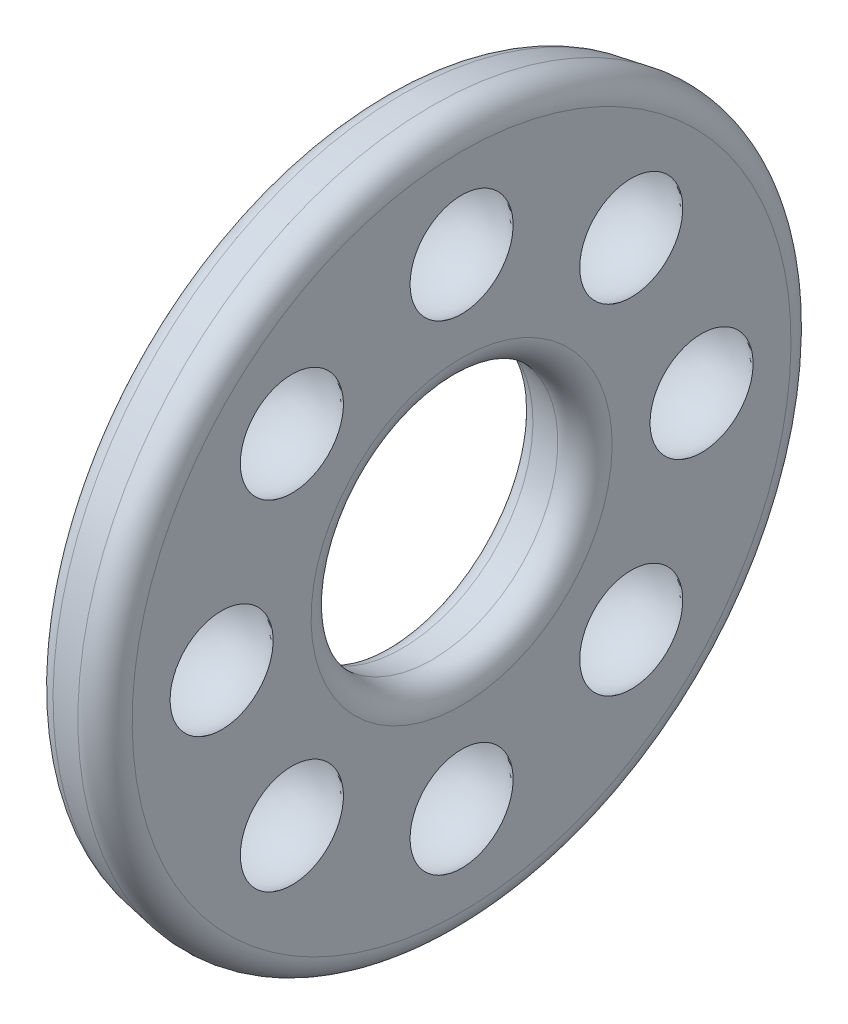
ISO-10303-21;
HEADER;
FILE_DESCRIPTION(('STEP AP214'),'2;1');
FILE_NAME('part.step','',(''),(''),'','','');
FILE_SCHEMA(('AUTOMOTIVE_DESIGN { 1 0 10303 214 1 1 1 1 }'));
ENDSEC;
DATA;
#1=APPLICATION_CONTEXT('core data for automotive mechanical design processes');
#2=APPLICATION_PROTOCOL_DEFINITION('international standard','automotive_design',2000,#1);
#3=PRODUCT_CONTEXT('',#1,'mechanical');
#4=PRODUCT('Part','Part','',(#3));
#5=PRODUCT_RELATED_PRODUCT_CATEGORY('part','',(#4));
#6=PRODUCT_DEFINITION_FORMATION('','',#4);
#7=PRODUCT_DEFINITION_CONTEXT('part definition',#1,'design');
#8=PRODUCT_DEFINITION('design','',#6,#7);
#9=PRODUCT_DEFINITION_SHAPE('','',#8);
#10=(LENGTH_UNIT() NAMED_UNIT(*) SI_UNIT(.MILLI.,.METRE.));
#11=(NAMED_UNIT(*) PLANE_ANGLE_UNIT() SI_UNIT($,.RADIAN.));
#12=(NAMED_UNIT(*) SI_UNIT($,.STERADIAN.) SOLID_ANGLE_UNIT());
#13=UNCERTAINTY_MEASURE_WITH_UNIT(LENGTH_MEASURE(1.E-05),#10,'distance_accuracy_value','');
#14=(GEOMETRIC_REPRESENTATION_CONTEXT(3) GLOBAL_UNCERTAINTY_ASSIGNED_CONTEXT((#13)) GLOBAL_UNIT_ASSIGNED_CONTEXT((#10,
#11,#12)) REPRESENTATION_CONTEXT('',''));
#15=CARTESIAN_POINT('',(0.,0.,0.));
#16=DIRECTION('',(0.,0.,1.));
#17=DIRECTION('',(1.,0.,0.));
#18=AXIS2_PLACEMENT_3D('',#15,#16,#17);
#19=CARTESIAN_POINT('',(13.64,10.5,0.));
#20=DIRECTION('',(-1.,0.,0.));
#21=DIRECTION('',(0.,0.,1.));
#22=AXIS2_PLACEMENT_3D('',#19,#20,#21);
#23=PLANE('',#22);
#24=CARTESIAN_POINT('',(13.64,0.,0.));
#25=DIRECTION('',(-1.,0.,0.));
#26=DIRECTION('',(0.,1.,0.));
#27=AXIS2_PLACEMENT_3D('',#24,#25,#26);
#28=CIRCLE('',#27,6.8186805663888);
#29=CARTESIAN_POINT('',(13.64,6.8186805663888,0.));
#30=VERTEX_POINT('',#29);
#31=EDGE_CURVE('E88',#30,#30,#28,.T.);
#32=ORIENTED_EDGE('',*,*,#31,.F.);
#33=EDGE_LOOP('',(#32));
#34=FACE_BOUND('',#33,.T.);
#35=CARTESIAN_POINT('',(13.64,10.5,0.));
#36=DIRECTION('',(1.,0.,0.));
#37=DIRECTION('',(0.,0.,-1.));
#38=AXIS2_PLACEMENT_3D('',#35,#36,#37);
#39=CIRCLE('',#38,2.25432916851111);
#40=CARTESIAN_POINT('',(13.64,10.5,-2.25432916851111));
#41=VERTEX_POINT('',#40);
#42=EDGE_CURVE('E11',#41,#41,#39,.T.);
#43=ORIENTED_EDGE('',*,*,#42,.T.);
#44=EDGE_LOOP('',(#43));
#45=FACE_BOUND('',#44,.T.);
#46=CARTESIAN_POINT('',(13.64,7.42462120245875,-7.42462120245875));
#47=DIRECTION('',(1.,0.,0.));
#48=DIRECTION('',(0.,0.,-1.));
#49=AXIS2_PLACEMENT_3D('',#46,#47,#48);
#50=CIRCLE('',#49,2.25432916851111);
#51=CARTESIAN_POINT('',(13.64,7.42462120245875,-9.67895037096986));
#52=VERTEX_POINT('',#51);
#53=EDGE_CURVE('E26',#52,#52,#50,.T.);
#54=ORIENTED_EDGE('',*,*,#53,.T.);
#55=EDGE_LOOP('',(#54));
#56=FACE_BOUND('',#55,.T.);
#57=CARTESIAN_POINT('',(13.64,0.,-10.5));
#58=DIRECTION('',(1.,0.,0.));
#59=DIRECTION('',(0.,0.,-1.));
#60=AXIS2_PLACEMENT_3D('',#57,#58,#59);
#61=CIRCLE('',#60,2.25432916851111);
#62=CARTESIAN_POINT('',(13.64,0.,-12.7543291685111));
#63=VERTEX_POINT('',#62);
#64=EDGE_CURVE('E136',#63,#63,#61,.T.);
#65=ORIENTED_EDGE('',*,*,#64,.T.);
#66=EDGE_LOOP('',(#65));
#67=FACE_BOUND('',#66,.T.);
#68=CARTESIAN_POINT('',(13.64,-7.42462120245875,-7.42462120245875));
#69=DIRECTION('',(1.,0.,0.));
#70=DIRECTION('',(0.,0.,-1.));
#71=AXIS2_PLACEMENT_3D('',#68,#69,#70);
#72=CIRCLE('',#71,2.25432916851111);
#73=CARTESIAN_POINT('',(13.64,-7.42462120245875,-9.67895037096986));
#74=VERTEX_POINT('',#73);
#75=EDGE_CURVE('E130',#74,#74,#72,.T.);
#76=ORIENTED_EDGE('',*,*,#75,.T.);
#77=EDGE_LOOP('',(#76));
#78=FACE_BOUND('',#77,.T.);
#79=CARTESIAN_POINT('',(13.64,-10.5,0.));
#80=DIRECTION('',(1.,0.,0.));
#81=DIRECTION('',(0.,0.,-1.));
#82=AXIS2_PLACEMENT_3D('',#79,#80,#81);
#83=CIRCLE('',#82,2.25432916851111);
#84=CARTESIAN_POINT('',(13.64,-10.5,-2.25432916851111));
#85=VERTEX_POINT('',#84);
#86=EDGE_CURVE('E127',#85,#85,#83,.T.);
#87=ORIENTED_EDGE('',*,*,#86,.T.);
#88=EDGE_LOOP('',(#87));
#89=FACE_BOUND('',#88,.T.);
#90=CARTESIAN_POINT('',(13.64,-7.42462120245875,7.42462120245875));
#91=DIRECTION('',(1.,0.,0.));
#92=DIRECTION('',(0.,0.,-1.));
#93=AXIS2_PLACEMENT_3D('',#90,#91,#92);
#94=CIRCLE('',#93,2.25432916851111);
#95=CARTESIAN_POINT('',(13.64,-7.42462120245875,5.17029203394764));
#96=VERTEX_POINT('',#95);
#97=EDGE_CURVE('E131',#96,#96,#94,.T.);
#98=ORIENTED_EDGE('',*,*,#97,.T.);
#99=EDGE_LOOP('',(#98));
#100=FACE_BOUND('',#99,.T.);
#101=CARTESIAN_POINT('',(13.64,0.,10.5));
#102=DIRECTION('',(1.,0.,0.));
#103=DIRECTION('',(0.,0.,-1.));
#104=AXIS2_PLACEMENT_3D('',#101,#102,#103);
#105=CIRCLE('',#104,2.25432916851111);
#106=CARTESIAN_POINT('',(13.64,0.,8.24567083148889));
#107=VERTEX_POINT('',#106);
#108=EDGE_CURVE('E145',#107,#107,#105,.T.);
#109=ORIENTED_EDGE('',*,*,#108,.T.);
#110=EDGE_LOOP('',(#109));
#111=FACE_BOUND('',#110,.T.);
#112=CARTESIAN_POINT('',(13.64,7.42462120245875,7.42462120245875));
#113=DIRECTION('',(1.,0.,0.));
#114=DIRECTION('',(0.,0.,-1.));
#115=AXIS2_PLACEMENT_3D('',#112,#113,#114);
#116=CIRCLE('',#115,2.25432916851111);
#117=CARTESIAN_POINT('',(13.64,7.42462120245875,5.17029203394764));
#118=VERTEX_POINT('',#117);
#119=EDGE_CURVE('E142',#118,#118,#116,.T.);
#120=ORIENTED_EDGE('',*,*,#119,.T.);
#121=EDGE_LOOP('',(#120));
#122=FACE_BOUND('',#121,.T.);
#123=CARTESIAN_POINT('',(13.64,0.,0.));
#124=DIRECTION('',(-1.,0.,0.));
#125=DIRECTION('',(0.,1.,0.));
#126=AXIS2_PLACEMENT_3D('',#123,#124,#125);
#127=CIRCLE('',#126,14.1813194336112);
#128=CARTESIAN_POINT('',(13.64,14.1813194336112,0.));
#129=VERTEX_POINT('',#128);
#130=EDGE_CURVE('E139',#129,#129,#127,.T.);
#131=ORIENTED_EDGE('',*,*,#130,.T.);
#132=EDGE_LOOP('',(#131));
#133=FACE_BOUND('',#132,.T.);
#134=ADVANCED_FACE('F17',(#34,#45,#56,#67,#78,#89,#100,#111,#122,#133),#23,.T.);
#135=CARTESIAN_POINT('',(17.16,10.5,0.));
#136=DIRECTION('',(1.,0.,0.));
#137=DIRECTION('',(0.,0.,-1.));
#138=AXIS2_PLACEMENT_3D('',#135,#136,#137);
#139=PLANE('',#138);
#140=CARTESIAN_POINT('',(17.16,0.,0.));
#141=DIRECTION('',(-1.,0.,0.));
#142=DIRECTION('',(0.,1.,0.));
#143=AXIS2_PLACEMENT_3D('',#140,#141,#142);
#144=CIRCLE('',#143,6.58592895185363);
#145=CARTESIAN_POINT('',(17.16,6.58592895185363,0.));
#146=VERTEX_POINT('',#145);
#147=EDGE_CURVE('E109',#146,#146,#144,.T.);
#148=ORIENTED_EDGE('',*,*,#147,.T.);
#149=EDGE_LOOP('',(#148));
#150=FACE_BOUND('',#149,.T.);
#151=CARTESIAN_POINT('',(17.16,10.5,0.));
#152=DIRECTION('',(-1.,0.,0.));
#153=DIRECTION('',(0.,0.,1.));
#154=AXIS2_PLACEMENT_3D('',#151,#152,#153);
#155=CIRCLE('',#154,2.25432916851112);
#156=CARTESIAN_POINT('',(17.16,10.5,2.25432916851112));
#157=VERTEX_POINT('',#156);
#158=EDGE_CURVE('E105',#157,#157,#155,.T.);
#159=ORIENTED_EDGE('',*,*,#158,.T.);
#160=EDGE_LOOP('',(#159));
#161=FACE_BOUND('',#160,.T.);
#162=CARTESIAN_POINT('',(17.16,7.42462120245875,-7.42462120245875));
#163=DIRECTION('',(-1.,0.,0.));
#164=DIRECTION('',(0.,0.,1.));
#165=AXIS2_PLACEMENT_3D('',#162,#163,#164);
#166=CIRCLE('',#165,2.25432916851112);
#167=CARTESIAN_POINT('',(17.16,7.42462120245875,-5.17029203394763));
#168=VERTEX_POINT('',#167);
#169=EDGE_CURVE('E102',#168,#168,#166,.T.);
#170=ORIENTED_EDGE('',*,*,#169,.T.);
#171=EDGE_LOOP('',(#170));
#172=FACE_BOUND('',#171,.T.);
#173=CARTESIAN_POINT('',(17.16,0.,-10.5));
#174=DIRECTION('',(-1.,0.,0.));
#175=DIRECTION('',(0.,0.,1.));
#176=AXIS2_PLACEMENT_3D('',#173,#174,#175);
#177=CIRCLE('',#176,2.25432916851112);
#178=CARTESIAN_POINT('',(17.16,0.,-8.24567083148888));
#179=VERTEX_POINT('',#178);
#180=EDGE_CURVE('E106',#179,#179,#177,.T.);
#181=ORIENTED_EDGE('',*,*,#180,.T.);
#182=EDGE_LOOP('',(#181));
#183=FACE_BOUND('',#182,.T.);
#184=CARTESIAN_POINT('',(17.16,-7.42462120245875,-7.42462120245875));
#185=DIRECTION('',(-1.,0.,0.));
#186=DIRECTION('',(0.,0.,1.));
#187=AXIS2_PLACEMENT_3D('',#184,#185,#186);
#188=CIRCLE('',#187,2.25432916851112);
#189=CARTESIAN_POINT('',(17.16,-7.42462120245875,-5.17029203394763));
#190=VERTEX_POINT('',#189);
#191=EDGE_CURVE('E120',#190,#190,#188,.T.);
#192=ORIENTED_EDGE('',*,*,#191,.T.);
#193=EDGE_LOOP('',(#192));
#194=FACE_BOUND('',#193,.T.);
#195=CARTESIAN_POINT('',(17.16,-10.5,0.));
#196=DIRECTION('',(-1.,0.,0.));
#197=DIRECTION('',(0.,0.,1.));
#198=AXIS2_PLACEMENT_3D('',#195,#196,#197);
#199=CIRCLE('',#198,2.25432916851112);
#200=CARTESIAN_POINT('',(17.16,-10.5,2.25432916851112));
#201=VERTEX_POINT('',#200);
#202=EDGE_CURVE('E119',#201,#201,#199,.T.);
#203=ORIENTED_EDGE('',*,*,#202,.T.);
#204=EDGE_LOOP('',(#203));
#205=FACE_BOUND('',#204,.T.);
#206=CARTESIAN_POINT('',(17.16,-7.42462120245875,7.42462120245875));
#207=DIRECTION('',(-1.,0.,0.));
#208=DIRECTION('',(0.,0.,1.));
#209=AXIS2_PLACEMENT_3D('',#206,#207,#208);
#210=CIRCLE('',#209,2.25432916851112);
#211=CARTESIAN_POINT('',(17.16,-7.42462120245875,9.67895037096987));
#212=VERTEX_POINT('',#211);
#213=EDGE_CURVE('E91',#212,#212,#210,.T.);
#214=ORIENTED_EDGE('',*,*,#213,.T.);
#215=EDGE_LOOP('',(#214));
#216=FACE_BOUND('',#215,.T.);
#217=CARTESIAN_POINT('',(17.16,0.,10.5));
#218=DIRECTION('',(-1.,0.,0.));
#219=DIRECTION('',(0.,0.,1.));
#220=AXIS2_PLACEMENT_3D('',#217,#218,#219);
#221=CIRCLE('',#220,2.25432916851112);
#222=CARTESIAN_POINT('',(17.16,0.,12.7543291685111));
#223=VERTEX_POINT('',#222);
#224=EDGE_CURVE('E87',#223,#223,#221,.T.);
#225=ORIENTED_EDGE('',*,*,#224,.T.);
#226=EDGE_LOOP('',(#225));
#227=FACE_BOUND('',#226,.T.);
#228=CARTESIAN_POINT('',(17.16,7.42462120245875,7.42462120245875));
#229=DIRECTION('',(-1.,0.,0.));
#230=DIRECTION('',(0.,0.,1.));
#231=AXIS2_PLACEMENT_3D('',#228,#229,#230);
#232=CIRCLE('',#231,2.25432916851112);
#233=CARTESIAN_POINT('',(17.16,7.42462120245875,9.67895037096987));
#234=VERTEX_POINT('',#233);
#235=EDGE_CURVE('E85',#234,#234,#232,.T.);
#236=ORIENTED_EDGE('',*,*,#235,.T.);
#237=EDGE_LOOP('',(#236));
#238=FACE_BOUND('',#237,.T.);
#239=CARTESIAN_POINT('',(17.16,0.,0.));
#240=DIRECTION('',(-1.,0.,0.));
#241=DIRECTION('',(0.,1.,0.));
#242=AXIS2_PLACEMENT_3D('',#239,#240,#241);
#243=CIRCLE('',#242,14.4140710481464);
#244=CARTESIAN_POINT('',(17.16,14.4140710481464,0.));
#245=VERTEX_POINT('',#244);
#246=EDGE_CURVE('E114',#245,#245,#243,.T.);
#247=ORIENTED_EDGE('',*,*,#246,.F.);
#248=EDGE_LOOP('',(#247));
#249=FACE_BOUND('',#248,.T.);
#250=ADVANCED_FACE('F80',(#150,#161,#172,#183,#194,#205,#216,#227,#238,#249),#139,.T.);
#251=CARTESIAN_POINT('',(15.4,7.42462120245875,7.42462120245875));
#252=DIRECTION('',(0.241206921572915,0.932245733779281,0.269698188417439));
#253=DIRECTION('',(-0.970471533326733,0.231116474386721,0.0690664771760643));
#254=AXIS2_PLACEMENT_3D('',#251,#252,#253);
#255=SPHERICAL_SURFACE('',#254,2.86);
#256=ORIENTED_EDGE('',*,*,#119,.F.);
#257=EDGE_LOOP('',(#256));
#258=FACE_BOUND('',#257,.T.);
#259=CARTESIAN_POINT('',(14.7101482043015,4.75839840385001,6.65328438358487));
#260=VERTEX_POINT('',#259);
#261=VERTEX_LOOP('',#260);
#262=FACE_BOUND('',#261,.T.);
#263=ORIENTED_EDGE('',*,*,#235,.F.);
#264=EDGE_LOOP('',(#263));
#265=FACE_BOUND('',#264,.T.);
#266=CARTESIAN_POINT('',(16.0898517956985,10.0908440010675,8.19595802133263));
#267=VERTEX_POINT('',#266);
#268=VERTEX_LOOP('',#267);
#269=FACE_BOUND('',#268,.T.);
#270=ADVANCED_FACE('F76',(#258,#262,#265,#269),#255,.F.);
#271=CARTESIAN_POINT('',(15.4,0.,10.5));
#272=DIRECTION('',(0.241206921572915,0.932245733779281,0.269698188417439));
#273=DIRECTION('',(-0.970471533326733,0.231116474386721,0.0690664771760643));
#274=AXIS2_PLACEMENT_3D('',#271,#272,#273);
#275=SPHERICAL_SURFACE('',#274,2.86);
#276=ORIENTED_EDGE('',*,*,#108,.F.);
#277=EDGE_LOOP('',(#276));
#278=FACE_BOUND('',#277,.T.);
#279=CARTESIAN_POINT('',(14.7101482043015,-2.66622279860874,9.72866318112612));
#280=VERTEX_POINT('',#279);
#281=VERTEX_LOOP('',#280);
#282=FACE_BOUND('',#281,.T.);
#283=ORIENTED_EDGE('',*,*,#224,.F.);
#284=EDGE_LOOP('',(#283));
#285=FACE_BOUND('',#284,.T.);
#286=CARTESIAN_POINT('',(16.0898517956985,2.66622279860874,11.2713368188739));
#287=VERTEX_POINT('',#286);
#288=VERTEX_LOOP('',#287);
#289=FACE_BOUND('',#288,.T.);
#290=ADVANCED_FACE('F79',(#278,#282,#285,#289),#275,.F.);
#291=CARTESIAN_POINT('',(15.4,-7.42462120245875,7.42462120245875));
#292=DIRECTION('',(0.241206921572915,0.932245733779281,0.269698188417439));
#293=DIRECTION('',(-0.970471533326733,0.231116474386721,0.0690664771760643));
#294=AXIS2_PLACEMENT_3D('',#291,#292,#293);
#295=SPHERICAL_SURFACE('',#294,2.86);
#296=ORIENTED_EDGE('',*,*,#97,.F.);
#297=EDGE_LOOP('',(#296));
#298=FACE_BOUND('',#297,.T.);
#299=CARTESIAN_POINT('',(14.7101482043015,-10.0908440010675,6.65328438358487));
#300=VERTEX_POINT('',#299);
#301=VERTEX_LOOP('',#300);
#302=FACE_BOUND('',#301,.T.);
#303=ORIENTED_EDGE('',*,*,#213,.F.);
#304=EDGE_LOOP('',(#303));
#305=FACE_BOUND('',#304,.T.);
#306=CARTESIAN_POINT('',(16.0898517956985,-4.75839840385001,8.19595802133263));
#307=VERTEX_POINT('',#306);
#308=VERTEX_LOOP('',#307);
#309=FACE_BOUND('',#308,.T.);
#310=ADVANCED_FACE('F157',(#298,#302,#305,#309),#295,.F.);
#311=CARTESIAN_POINT('',(15.4,-10.5,0.));
#312=DIRECTION('',(0.241206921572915,0.932245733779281,0.269698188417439));
#313=DIRECTION('',(-0.970471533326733,0.231116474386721,0.0690664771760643));
#314=AXIS2_PLACEMENT_3D('',#311,#312,#313);
#315=SPHERICAL_SURFACE('',#314,2.86);
#316=ORIENTED_EDGE('',*,*,#86,.F.);
#317=EDGE_LOOP('',(#316));
#318=FACE_BOUND('',#317,.T.);
#319=CARTESIAN_POINT('',(14.7101482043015,-13.1662227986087,-0.771336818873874));
#320=VERTEX_POINT('',#319);
#321=VERTEX_LOOP('',#320);
#322=FACE_BOUND('',#321,.T.);
#323=ORIENTED_EDGE('',*,*,#202,.F.);
#324=EDGE_LOOP('',(#323));
#325=FACE_BOUND('',#324,.T.);
#326=CARTESIAN_POINT('',(16.0898517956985,-7.83377720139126,0.771336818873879));
#327=VERTEX_POINT('',#326);
#328=VERTEX_LOOP('',#327);
#329=FACE_BOUND('',#328,.T.);
#330=ADVANCED_FACE('F161',(#318,#322,#325,#329),#315,.F.);
#331=CARTESIAN_POINT('',(15.4,-7.42462120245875,-7.42462120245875));
#332=DIRECTION('',(0.241206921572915,0.932245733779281,0.269698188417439));
#333=DIRECTION('',(-0.970471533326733,0.231116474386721,0.0690664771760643));
#334=AXIS2_PLACEMENT_3D('',#331,#332,#333);
#335=SPHERICAL_SURFACE('',#334,2.86);
#336=ORIENTED_EDGE('',*,*,#75,.F.);
#337=EDGE_LOOP('',(#336));
#338=FACE_BOUND('',#337,.T.);
#339=CARTESIAN_POINT('',(14.7101482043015,-10.0908440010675,-8.19595802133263));
#340=VERTEX_POINT('',#339);
#341=VERTEX_LOOP('',#340);
#342=FACE_BOUND('',#341,.T.);
#343=ORIENTED_EDGE('',*,*,#191,.F.);
#344=EDGE_LOOP('',(#343));
#345=FACE_BOUND('',#344,.T.);
#346=CARTESIAN_POINT('',(16.0898517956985,-4.75839840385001,-6.65328438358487));
#347=VERTEX_POINT('',#346);
#348=VERTEX_LOOP('',#347);
#349=FACE_BOUND('',#348,.T.);
#350=ADVANCED_FACE('F172',(#338,#342,#345,#349),#335,.F.);
#351=CARTESIAN_POINT('',(15.4,0.,-10.5));
#352=DIRECTION('',(0.241206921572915,0.932245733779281,0.269698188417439));
#353=DIRECTION('',(-0.970471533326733,0.231116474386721,0.0690664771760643));
#354=AXIS2_PLACEMENT_3D('',#351,#352,#353);
#355=SPHERICAL_SURFACE('',#354,2.86);
#356=ORIENTED_EDGE('',*,*,#64,.F.);
#357=EDGE_LOOP('',(#356));
#358=FACE_BOUND('',#357,.T.);
#359=CARTESIAN_POINT('',(14.7101482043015,-2.66622279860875,-11.2713368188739));
#360=VERTEX_POINT('',#359);
#361=VERTEX_LOOP('',#360);
#362=FACE_BOUND('',#361,.T.);
#363=ORIENTED_EDGE('',*,*,#180,.F.);
#364=EDGE_LOOP('',(#363));
#365=FACE_BOUND('',#364,.T.);
#366=CARTESIAN_POINT('',(16.0898517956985,2.66622279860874,-9.72866318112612));
#367=VERTEX_POINT('',#366);
#368=VERTEX_LOOP('',#367);
#369=FACE_BOUND('',#368,.T.);
#370=ADVANCED_FACE('F175',(#358,#362,#365,#369),#355,.F.);
#371=CARTESIAN_POINT('',(15.4,7.42462120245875,-7.42462120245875));
#372=DIRECTION('',(0.241206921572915,0.932245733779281,0.269698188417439));
#373=DIRECTION('',(-0.970471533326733,0.231116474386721,0.0690664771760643));
#374=AXIS2_PLACEMENT_3D('',#371,#372,#373);
#375=SPHERICAL_SURFACE('',#374,2.86);
#376=ORIENTED_EDGE('',*,*,#53,.F.);
#377=EDGE_LOOP('',(#376));
#378=FACE_BOUND('',#377,.T.);
#379=CARTESIAN_POINT('',(14.7101482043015,4.75839840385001,-8.19595802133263));
#380=VERTEX_POINT('',#379);
#381=VERTEX_LOOP('',#380);
#382=FACE_BOUND('',#381,.T.);
#383=ORIENTED_EDGE('',*,*,#169,.F.);
#384=EDGE_LOOP('',(#383));
#385=FACE_BOUND('',#384,.T.);
#386=CARTESIAN_POINT('',(16.0898517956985,10.0908440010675,-6.65328438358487));
#387=VERTEX_POINT('',#386);
#388=VERTEX_LOOP('',#387);
#389=FACE_BOUND('',#388,.T.);
#390=ADVANCED_FACE('F179',(#378,#382,#385,#389),#375,.F.);
#391=CARTESIAN_POINT('',(15.4,10.5,0.));
#392=DIRECTION('',(0.241206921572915,0.932245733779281,0.269698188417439));
#393=DIRECTION('',(-0.970471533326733,0.231116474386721,0.0690664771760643));
#394=AXIS2_PLACEMENT_3D('',#391,#392,#393);
#395=SPHERICAL_SURFACE('',#394,2.86);
#396=ORIENTED_EDGE('',*,*,#42,.F.);
#397=EDGE_LOOP('',(#396));
#398=FACE_BOUND('',#397,.T.);
#399=CARTESIAN_POINT('',(14.7101482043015,7.83377720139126,-0.771336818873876));
#400=VERTEX_POINT('',#399);
#401=VERTEX_LOOP('',#400);
#402=FACE_BOUND('',#401,.T.);
#403=ORIENTED_EDGE('',*,*,#158,.F.);
#404=EDGE_LOOP('',(#403));
#405=FACE_BOUND('',#404,.T.);
#406=CARTESIAN_POINT('',(16.0898517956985,13.1662227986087,0.771336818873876));
#407=VERTEX_POINT('',#406);
#408=VERTEX_LOOP('',#407);
#409=FACE_BOUND('',#408,.T.);
#410=ADVANCED_FACE('F183',(#398,#402,#405,#409),#395,.F.);
#411=CARTESIAN_POINT('',(14.74,0.,0.));
#412=DIRECTION('',(-1.,0.,0.));
#413=DIRECTION('',(0.,0.,1.));
#414=AXIS2_PLACEMENT_3D('',#411,#412,#413);
#415=TOROIDAL_SURFACE('',#414,6.8186805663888,1.1);
#416=ORIENTED_EDGE('',*,*,#31,.T.);
#417=EDGE_LOOP('',(#416));
#418=FACE_BOUND('',#417,.T.);
#419=CARTESIAN_POINT('',(14.5489870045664,0.,0.));
#420=DIRECTION('',(-1.,0.,0.));
#421=DIRECTION('',(0.,1.,0.));
#422=AXIS2_PLACEMENT_3D('',#419,#420,#421);
#423=CIRCLE('',#422,5.73539203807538);
#424=CARTESIAN_POINT('',(14.5489870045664,5.73539203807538,0.));
#425=VERTEX_POINT('',#424);
#426=EDGE_CURVE('E94',#425,#425,#423,.T.);
#427=ORIENTED_EDGE('',*,*,#426,.F.);
#428=EDGE_LOOP('',(#427));
#429=FACE_BOUND('',#428,.T.);
#430=ADVANCED_FACE('F194',(#418,#429),#415,.T.);
#431=DIRECTION('',(-0.984807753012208,0.17364817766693,0.));
#432=VECTOR('',#431,1.);
#433=CARTESIAN_POINT('',(-499000.,87995.464144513,-2.15519608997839E-11));
#434=LINE('',#433,#432);
#435=CARTESIAN_POINT('',(47.0760115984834,0.,0.));
#436=DIRECTION('',(-1.,0.,0.));
#437=AXIS1_PLACEMENT('',#435,#436);
#438=SURFACE_OF_REVOLUTION('',#434,#437);
#439=ORIENTED_EDGE('',*,*,#426,.T.);
#440=EDGE_LOOP('',(#439));
#441=FACE_BOUND('',#440,.T.);
#442=CARTESIAN_POINT('',(15.8689870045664,0.,0.));
#443=DIRECTION('',(-1.,0.,0.));
#444=DIRECTION('',(0.,1.,0.));
#445=AXIS2_PLACEMENT_3D('',#442,#443,#444);
#446=CIRCLE('',#445,5.5026404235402);
#447=CARTESIAN_POINT('',(15.8689870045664,5.5026404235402,0.));
#448=VERTEX_POINT('',#447);
#449=EDGE_CURVE('E110',#448,#448,#446,.T.);
#450=ORIENTED_EDGE('',*,*,#449,.F.);
#451=EDGE_LOOP('',(#450));
#452=FACE_BOUND('',#451,.T.);
#453=ADVANCED_FACE('F197',(#441,#452),#438,.F.);
#454=DIRECTION('',(-0.984807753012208,-0.17364817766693,0.));
#455=VECTOR('',#454,1.);
#456=CARTESIAN_POINT('',(15.2089870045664,15.3809837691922,0.));
#457=LINE('',#456,#455);
#458=CARTESIAN_POINT('',(-72.0209066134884,0.,0.));
#459=DIRECTION('',(1.,0.,0.));
#460=AXIS1_PLACEMENT('',#458,#459);
#461=SURFACE_OF_REVOLUTION('',#457,#460);
#462=CARTESIAN_POINT('',(14.5489870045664,0.,0.));
#463=DIRECTION('',(-1.,0.,0.));
#464=DIRECTION('',(0.,1.,0.));
#465=AXIS2_PLACEMENT_3D('',#462,#463,#464);
#466=CIRCLE('',#465,15.2646079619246);
#467=CARTESIAN_POINT('',(14.5489870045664,15.2646079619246,0.));
#468=VERTEX_POINT('',#467);
#469=EDGE_CURVE('E113',#468,#468,#466,.T.);
#470=ORIENTED_EDGE('',*,*,#469,.F.);
#471=EDGE_LOOP('',(#470));
#472=FACE_BOUND('',#471,.T.);
#473=CARTESIAN_POINT('',(15.8689870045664,0.,0.));
#474=DIRECTION('',(-1.,0.,0.));
#475=DIRECTION('',(0.,1.,0.));
#476=AXIS2_PLACEMENT_3D('',#473,#474,#475);
#477=CIRCLE('',#476,15.4973595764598);
#478=CARTESIAN_POINT('',(15.8689870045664,15.4973595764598,0.));
#479=VERTEX_POINT('',#478);
#480=EDGE_CURVE('E101',#479,#479,#477,.T.);
#481=ORIENTED_EDGE('',*,*,#480,.T.);
#482=EDGE_LOOP('',(#481));
#483=FACE_BOUND('',#482,.T.);
#484=ADVANCED_FACE('F201',(#472,#483),#461,.F.);
#485=CARTESIAN_POINT('',(14.74,0.,0.));
#486=DIRECTION('',(-1.,0.,0.));
#487=DIRECTION('',(0.,0.,1.));
#488=AXIS2_PLACEMENT_3D('',#485,#486,#487);
#489=TOROIDAL_SURFACE('',#488,14.1813194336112,1.1);
#490=ORIENTED_EDGE('',*,*,#469,.T.);
#491=EDGE_LOOP('',(#490));
#492=FACE_BOUND('',#491,.T.);
#493=ORIENTED_EDGE('',*,*,#130,.F.);
#494=EDGE_LOOP('',(#493));
#495=FACE_BOUND('',#494,.T.);
#496=ADVANCED_FACE('F205',(#492,#495),#489,.T.);
#497=CARTESIAN_POINT('',(16.06,0.,0.));
#498=DIRECTION('',(-1.,0.,0.));
#499=DIRECTION('',(0.,0.,1.));
#500=AXIS2_PLACEMENT_3D('',#497,#498,#499);
#501=TOROIDAL_SURFACE('',#500,6.58592895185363,1.1);
#502=ORIENTED_EDGE('',*,*,#147,.F.);
#503=EDGE_LOOP('',(#502));
#504=FACE_BOUND('',#503,.T.);
#505=ORIENTED_EDGE('',*,*,#449,.T.);
#506=EDGE_LOOP('',(#505));
#507=FACE_BOUND('',#506,.T.);
#508=ADVANCED_FACE('F211',(#504,#507),#501,.T.);
#509=CARTESIAN_POINT('',(16.06,0.,0.));
#510=DIRECTION('',(-1.,0.,0.));
#511=DIRECTION('',(0.,0.,1.));
#512=AXIS2_PLACEMENT_3D('',#509,#510,#511);
#513=TOROIDAL_SURFACE('',#512,14.4140710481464,1.1);
#514=ORIENTED_EDGE('',*,*,#246,.T.);
#515=EDGE_LOOP('',(#514));
#516=FACE_BOUND('',#515,.T.);
#517=ORIENTED_EDGE('',*,*,#480,.F.);
#518=EDGE_LOOP('',(#517));
#519=FACE_BOUND('',#518,.T.);
#520=ADVANCED_FACE('F19',(#516,#519),#513,.T.);
#521=CLOSED_SHELL('',(#134,#250,#270,#290,#310,#330,#350,#370,#390,#410,#430,#453,#484,#496,
#508,#520));
#522=MANIFOLD_SOLID_BREP('B1',#521);
#523=ADVANCED_BREP_SHAPE_REPRESENTATION('',(#18,#522),#14);
#524=SHAPE_DEFINITION_REPRESENTATION(#9,#523);
ENDSEC;
END-ISO-10303-21;
